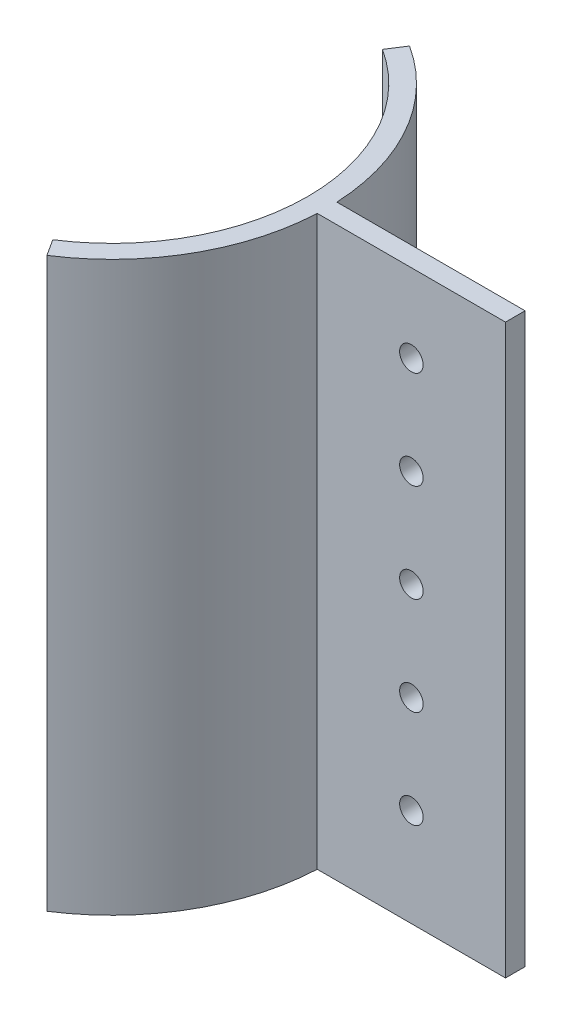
ISO-10303-21;
HEADER;
FILE_DESCRIPTION(('STEP AP214'),'2;1');
FILE_NAME('part.step','',(''),(''),'','','');
FILE_SCHEMA(('AUTOMOTIVE_DESIGN { 1 0 10303 214 1 1 1 1 }'));
ENDSEC;
DATA;
#1=APPLICATION_CONTEXT('core data for automotive mechanical design processes');
#2=APPLICATION_PROTOCOL_DEFINITION('international standard','automotive_design',2000,#1);
#3=PRODUCT_CONTEXT('',#1,'mechanical');
#4=PRODUCT('Part','Part','',(#3));
#5=PRODUCT_RELATED_PRODUCT_CATEGORY('part','',(#4));
#6=PRODUCT_DEFINITION_FORMATION('','',#4);
#7=PRODUCT_DEFINITION_CONTEXT('part definition',#1,'design');
#8=PRODUCT_DEFINITION('design','',#6,#7);
#9=PRODUCT_DEFINITION_SHAPE('','',#8);
#10=(LENGTH_UNIT() NAMED_UNIT(*) SI_UNIT(.MILLI.,.METRE.));
#11=(NAMED_UNIT(*) PLANE_ANGLE_UNIT() SI_UNIT($,.RADIAN.));
#12=(NAMED_UNIT(*) SI_UNIT($,.STERADIAN.) SOLID_ANGLE_UNIT());
#13=UNCERTAINTY_MEASURE_WITH_UNIT(LENGTH_MEASURE(1.E-05),#10,'distance_accuracy_value','');
#14=(GEOMETRIC_REPRESENTATION_CONTEXT(3) GLOBAL_UNCERTAINTY_ASSIGNED_CONTEXT((#13)) GLOBAL_UNIT_ASSIGNED_CONTEXT((#10,
#11,#12)) REPRESENTATION_CONTEXT('',''));
#15=CARTESIAN_POINT('',(0.,0.,0.));
#16=DIRECTION('',(0.,0.,1.));
#17=DIRECTION('',(1.,0.,0.));
#18=AXIS2_PLACEMENT_3D('',#15,#16,#17);
#19=CARTESIAN_POINT('',(39.4857881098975,-23.75,1.25));
#20=DIRECTION('',(0.,0.,1.));
#21=DIRECTION('',(1.,0.,0.));
#22=AXIS2_PLACEMENT_3D('',#19,#20,#21);
#23=CYLINDRICAL_SURFACE('',#22,1.5);
#24=CARTESIAN_POINT('',(39.4857881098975,-23.75,-1.225));
#25=DIRECTION('',(0.,0.,1.));
#26=DIRECTION('',(1.,0.,0.));
#27=AXIS2_PLACEMENT_3D('',#24,#25,#26);
#28=CIRCLE('',#27,1.5);
#29=CARTESIAN_POINT('',(40.9857881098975,-23.75,-1.225));
#30=VERTEX_POINT('',#29);
#31=EDGE_CURVE('E11',#30,#30,#28,.T.);
#32=ORIENTED_EDGE('',*,*,#31,.F.);
#33=EDGE_LOOP('',(#32));
#34=FACE_BOUND('',#33,.T.);
#35=CARTESIAN_POINT('',(39.4857881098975,-23.75,1.25));
#36=DIRECTION('',(0.,0.,1.));
#37=DIRECTION('',(1.,0.,0.));
#38=AXIS2_PLACEMENT_3D('',#35,#36,#37);
#39=CIRCLE('',#38,1.5);
#40=CARTESIAN_POINT('',(40.9857881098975,-23.75,1.25));
#41=VERTEX_POINT('',#40);
#42=EDGE_CURVE('E186',#41,#41,#39,.T.);
#43=ORIENTED_EDGE('',*,*,#42,.T.);
#44=EDGE_LOOP('',(#43));
#45=FACE_BOUND('',#44,.T.);
#46=ADVANCED_FACE('F36',(#34,#45),#23,.F.);
#47=CARTESIAN_POINT('',(39.4857881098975,-23.75,-1.225));
#48=DIRECTION('',(0.,0.,-1.));
#49=DIRECTION('',(-1.,0.,0.));
#50=AXIS2_PLACEMENT_3D('',#47,#48,#49);
#51=CONICAL_SURFACE('',#50,1.5,0.78539816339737);
#52=CARTESIAN_POINT('',(39.4857881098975,-23.75,-1.25));
#53=DIRECTION('',(0.,0.,1.));
#54=DIRECTION('',(1.,0.,0.));
#55=AXIS2_PLACEMENT_3D('',#52,#53,#54);
#56=CIRCLE('',#55,1.525);
#57=CARTESIAN_POINT('',(41.0107881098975,-23.75,-1.25));
#58=VERTEX_POINT('',#57);
#59=EDGE_CURVE('E43',#58,#58,#56,.T.);
#60=ORIENTED_EDGE('',*,*,#59,.F.);
#61=EDGE_LOOP('',(#60));
#62=FACE_BOUND('',#61,.T.);
#63=ORIENTED_EDGE('',*,*,#31,.T.);
#64=EDGE_LOOP('',(#63));
#65=FACE_BOUND('',#64,.T.);
#66=ADVANCED_FACE('F193',(#62,#65),#51,.F.);
#67=CARTESIAN_POINT('',(39.4857881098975,-11.25,1.25));
#68=DIRECTION('',(0.,0.,1.));
#69=DIRECTION('',(1.,0.,0.));
#70=AXIS2_PLACEMENT_3D('',#67,#68,#69);
#71=CYLINDRICAL_SURFACE('',#70,1.5);
#72=CARTESIAN_POINT('',(39.4857881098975,-11.25,-1.225));
#73=DIRECTION('',(0.,0.,1.));
#74=DIRECTION('',(1.,0.,0.));
#75=AXIS2_PLACEMENT_3D('',#72,#73,#74);
#76=CIRCLE('',#75,1.5);
#77=CARTESIAN_POINT('',(40.9857881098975,-11.25,-1.225));
#78=VERTEX_POINT('',#77);
#79=EDGE_CURVE('E183',#78,#78,#76,.T.);
#80=ORIENTED_EDGE('',*,*,#79,.F.);
#81=EDGE_LOOP('',(#80));
#82=FACE_BOUND('',#81,.T.);
#83=CARTESIAN_POINT('',(39.4857881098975,-11.25,1.25));
#84=DIRECTION('',(0.,0.,1.));
#85=DIRECTION('',(1.,0.,0.));
#86=AXIS2_PLACEMENT_3D('',#83,#84,#85);
#87=CIRCLE('',#86,1.5);
#88=CARTESIAN_POINT('',(40.9857881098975,-11.25,1.25));
#89=VERTEX_POINT('',#88);
#90=EDGE_CURVE('E177',#89,#89,#87,.T.);
#91=ORIENTED_EDGE('',*,*,#90,.T.);
#92=EDGE_LOOP('',(#91));
#93=FACE_BOUND('',#92,.T.);
#94=ADVANCED_FACE('F196',(#82,#93),#71,.F.);
#95=CARTESIAN_POINT('',(39.4857881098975,-11.25,-1.225));
#96=DIRECTION('',(0.,0.,-1.));
#97=DIRECTION('',(-1.,0.,0.));
#98=AXIS2_PLACEMENT_3D('',#95,#96,#97);
#99=CONICAL_SURFACE('',#98,1.5,0.78539816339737);
#100=CARTESIAN_POINT('',(39.4857881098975,-11.25,-1.25));
#101=DIRECTION('',(0.,0.,1.));
#102=DIRECTION('',(1.,0.,0.));
#103=AXIS2_PLACEMENT_3D('',#100,#101,#102);
#104=CIRCLE('',#103,1.525);
#105=CARTESIAN_POINT('',(41.0107881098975,-11.25,-1.25));
#106=VERTEX_POINT('',#105);
#107=EDGE_CURVE('E180',#106,#106,#104,.T.);
#108=ORIENTED_EDGE('',*,*,#107,.F.);
#109=EDGE_LOOP('',(#108));
#110=FACE_BOUND('',#109,.T.);
#111=ORIENTED_EDGE('',*,*,#79,.T.);
#112=EDGE_LOOP('',(#111));
#113=FACE_BOUND('',#112,.T.);
#114=ADVANCED_FACE('F249',(#110,#113),#99,.F.);
#115=CARTESIAN_POINT('',(39.4857881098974,1.24999999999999,1.25));
#116=DIRECTION('',(0.,0.,1.));
#117=DIRECTION('',(1.,0.,0.));
#118=AXIS2_PLACEMENT_3D('',#115,#116,#117);
#119=CYLINDRICAL_SURFACE('',#118,1.5);
#120=CARTESIAN_POINT('',(39.4857881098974,1.24999999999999,-1.225));
#121=DIRECTION('',(0.,0.,1.));
#122=DIRECTION('',(1.,0.,0.));
#123=AXIS2_PLACEMENT_3D('',#120,#121,#122);
#124=CIRCLE('',#123,1.5);
#125=CARTESIAN_POINT('',(40.9857881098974,1.24999999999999,-1.225));
#126=VERTEX_POINT('',#125);
#127=EDGE_CURVE('E174',#126,#126,#124,.T.);
#128=ORIENTED_EDGE('',*,*,#127,.F.);
#129=EDGE_LOOP('',(#128));
#130=FACE_BOUND('',#129,.T.);
#131=CARTESIAN_POINT('',(39.4857881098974,1.24999999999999,1.25));
#132=DIRECTION('',(0.,0.,1.));
#133=DIRECTION('',(1.,0.,0.));
#134=AXIS2_PLACEMENT_3D('',#131,#132,#133);
#135=CIRCLE('',#134,1.5);
#136=CARTESIAN_POINT('',(40.9857881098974,1.24999999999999,1.25));
#137=VERTEX_POINT('',#136);
#138=EDGE_CURVE('E168',#137,#137,#135,.T.);
#139=ORIENTED_EDGE('',*,*,#138,.T.);
#140=EDGE_LOOP('',(#139));
#141=FACE_BOUND('',#140,.T.);
#142=ADVANCED_FACE('F245',(#130,#141),#119,.F.);
#143=CARTESIAN_POINT('',(39.4857881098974,1.24999999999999,-1.225));
#144=DIRECTION('',(0.,0.,-1.));
#145=DIRECTION('',(-1.,0.,0.));
#146=AXIS2_PLACEMENT_3D('',#143,#144,#145);
#147=CONICAL_SURFACE('',#146,1.5,0.78539816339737);
#148=CARTESIAN_POINT('',(39.4857881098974,1.24999999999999,-1.25));
#149=DIRECTION('',(0.,0.,1.));
#150=DIRECTION('',(1.,0.,0.));
#151=AXIS2_PLACEMENT_3D('',#148,#149,#150);
#152=CIRCLE('',#151,1.525);
#153=CARTESIAN_POINT('',(41.0107881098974,1.24999999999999,-1.25));
#154=VERTEX_POINT('',#153);
#155=EDGE_CURVE('E171',#154,#154,#152,.T.);
#156=ORIENTED_EDGE('',*,*,#155,.F.);
#157=EDGE_LOOP('',(#156));
#158=FACE_BOUND('',#157,.T.);
#159=ORIENTED_EDGE('',*,*,#127,.T.);
#160=EDGE_LOOP('',(#159));
#161=FACE_BOUND('',#160,.T.);
#162=ADVANCED_FACE('F242',(#158,#161),#147,.F.);
#163=CARTESIAN_POINT('',(0.,36.25,0.));
#164=DIRECTION('',(0.,-1.,0.));
#165=DIRECTION('',(0.,0.,-1.));
#166=AXIS2_PLACEMENT_3D('',#163,#164,#165);
#167=CYLINDRICAL_SURFACE('',#166,27.5);
#168=CARTESIAN_POINT('',(0.,-36.25,0.));
#169=DIRECTION('',(0.,1.,0.));
#170=DIRECTION('',(1.,0.,0.));
#171=AXIS2_PLACEMENT_3D('',#168,#169,#170);
#172=CIRCLE('',#171,27.5);
#173=CARTESIAN_POINT('',(27.4715762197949,-36.25,1.25));
#174=VERTEX_POINT('',#173);
#175=CARTESIAN_POINT('',(14.8583134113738,-36.25,23.1404520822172));
#176=VERTEX_POINT('',#175);
#177=EDGE_CURVE('E55',#174,#176,#172,.F.);
#178=ORIENTED_EDGE('',*,*,#177,.F.);
#179=DIRECTION('',(0.,-1.,0.));
#180=VECTOR('',#179,1.);
#181=CARTESIAN_POINT('',(27.4715762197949,36.25,1.25));
#182=LINE('',#181,#180);
#183=CARTESIAN_POINT('',(27.4715762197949,36.25,1.25));
#184=VERTEX_POINT('',#183);
#185=EDGE_CURVE('E50',#174,#184,#182,.F.);
#186=ORIENTED_EDGE('',*,*,#185,.T.);
#187=CARTESIAN_POINT('',(0.,36.25,0.));
#188=DIRECTION('',(0.,1.,0.));
#189=DIRECTION('',(1.,0.,0.));
#190=AXIS2_PLACEMENT_3D('',#187,#188,#189);
#191=CIRCLE('',#190,27.5);
#192=CARTESIAN_POINT('',(14.8583134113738,36.25,23.1404520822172));
#193=VERTEX_POINT('',#192);
#194=EDGE_CURVE('E105',#184,#193,#191,.F.);
#195=ORIENTED_EDGE('',*,*,#194,.T.);
#196=DIRECTION('',(0.,-1.,0.));
#197=VECTOR('',#196,1.);
#198=CARTESIAN_POINT('',(14.8583134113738,36.25,23.1404520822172));
#199=LINE('',#198,#197);
#200=EDGE_CURVE('E164',#193,#176,#199,.T.);
#201=ORIENTED_EDGE('',*,*,#200,.T.);
#202=EDGE_LOOP('',(#178,#186,#195,#201));
#203=FACE_BOUND('',#202,.T.);
#204=ADVANCED_FACE('F234',(#203),#167,.T.);
#205=CARTESIAN_POINT('',(0.,36.25,0.));
#206=DIRECTION('',(0.,-1.,0.));
#207=DIRECTION('',(0.,0.,-1.));
#208=AXIS2_PLACEMENT_3D('',#205,#206,#207);
#209=CYLINDRICAL_SURFACE('',#208,25.);
#210=CARTESIAN_POINT('',(0.,-36.25,0.));
#211=DIRECTION('',(0.,-1.,0.));
#212=DIRECTION('',(0.,0.,-1.));
#213=AXIS2_PLACEMENT_3D('',#210,#211,#212);
#214=CIRCLE('',#213,25.);
#215=CARTESIAN_POINT('',(13.5075576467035,-36.25,-21.0367746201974));
#216=VERTEX_POINT('',#215);
#217=CARTESIAN_POINT('',(13.5075576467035,-36.25,21.0367746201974));
#218=VERTEX_POINT('',#217);
#219=EDGE_CURVE('E138',#216,#218,#214,.T.);
#220=ORIENTED_EDGE('',*,*,#219,.T.);
#221=DIRECTION('',(0.,-1.,0.));
#222=VECTOR('',#221,1.);
#223=CARTESIAN_POINT('',(13.5075576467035,36.25,21.0367746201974));
#224=LINE('',#223,#222);
#225=CARTESIAN_POINT('',(13.5075576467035,36.25,21.0367746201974));
#226=VERTEX_POINT('',#225);
#227=EDGE_CURVE('E166',#226,#218,#224,.T.);
#228=ORIENTED_EDGE('',*,*,#227,.F.);
#229=CARTESIAN_POINT('',(0.,36.25,0.));
#230=DIRECTION('',(0.,-1.,0.));
#231=DIRECTION('',(0.,0.,-1.));
#232=AXIS2_PLACEMENT_3D('',#229,#230,#231);
#233=CIRCLE('',#232,25.);
#234=CARTESIAN_POINT('',(13.5075576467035,36.25,-21.0367746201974));
#235=VERTEX_POINT('',#234);
#236=EDGE_CURVE('E139',#235,#226,#233,.T.);
#237=ORIENTED_EDGE('',*,*,#236,.F.);
#238=DIRECTION('',(0.,-1.,0.));
#239=VECTOR('',#238,1.);
#240=CARTESIAN_POINT('',(13.5075576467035,36.25,-21.0367746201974));
#241=LINE('',#240,#239);
#242=EDGE_CURVE('E150',#235,#216,#241,.T.);
#243=ORIENTED_EDGE('',*,*,#242,.T.);
#244=EDGE_LOOP('',(#220,#228,#237,#243));
#245=FACE_BOUND('',#244,.T.);
#246=ADVANCED_FACE('F237',(#245),#209,.F.);
#247=CARTESIAN_POINT('',(14.8583134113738,36.25,23.1404520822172));
#248=DIRECTION('',(-0.841470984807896,0.,0.540302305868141));
#249=DIRECTION('',(0.540302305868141,0.,0.841470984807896));
#250=AXIS2_PLACEMENT_3D('',#247,#248,#249);
#251=PLANE('',#250);
#252=DIRECTION('',(-0.540302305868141,0.,-0.841470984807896));
#253=VECTOR('',#252,1.);
#254=CARTESIAN_POINT('',(14.8583134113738,-36.25,23.1404520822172));
#255=LINE('',#254,#253);
#256=EDGE_CURVE('E153',#176,#218,#255,.T.);
#257=ORIENTED_EDGE('',*,*,#256,.F.);
#258=ORIENTED_EDGE('',*,*,#200,.F.);
#259=DIRECTION('',(-0.540302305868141,0.,-0.841470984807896));
#260=VECTOR('',#259,1.);
#261=CARTESIAN_POINT('',(14.8583134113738,36.25,23.1404520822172));
#262=LINE('',#261,#260);
#263=EDGE_CURVE('E141',#193,#226,#262,.T.);
#264=ORIENTED_EDGE('',*,*,#263,.T.);
#265=ORIENTED_EDGE('',*,*,#227,.T.);
#266=EDGE_LOOP('',(#257,#258,#264,#265));
#267=FACE_BOUND('',#266,.T.);
#268=ADVANCED_FACE('F232',(#267),#251,.T.);
#269=DIRECTION('',(0.,-1.,0.));
#270=VECTOR('',#269,1.);
#271=CARTESIAN_POINT('',(27.4715762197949,36.25,-1.25));
#272=LINE('',#271,#270);
#273=CARTESIAN_POINT('',(27.4715762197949,-36.25,-1.25));
#274=VERTEX_POINT('',#273);
#275=CARTESIAN_POINT('',(27.4715762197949,36.25,-1.25));
#276=VERTEX_POINT('',#275);
#277=EDGE_CURVE('E133',#274,#276,#272,.F.);
#278=ORIENTED_EDGE('',*,*,#277,.F.);
#279=CARTESIAN_POINT('',(14.8583134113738,-36.25,-23.1404520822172));
#280=VERTEX_POINT('',#279);
#281=EDGE_CURVE('E156',#280,#274,#172,.F.);
#282=ORIENTED_EDGE('',*,*,#281,.F.);
#283=DIRECTION('',(0.,-1.,0.));
#284=VECTOR('',#283,1.);
#285=CARTESIAN_POINT('',(14.8583134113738,36.25,-23.1404520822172));
#286=LINE('',#285,#284);
#287=CARTESIAN_POINT('',(14.8583134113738,36.25,-23.1404520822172));
#288=VERTEX_POINT('',#287);
#289=EDGE_CURVE('E162',#288,#280,#286,.T.);
#290=ORIENTED_EDGE('',*,*,#289,.F.);
#291=EDGE_CURVE('E145',#288,#276,#191,.F.);
#292=ORIENTED_EDGE('',*,*,#291,.T.);
#293=EDGE_LOOP('',(#278,#282,#290,#292));
#294=FACE_BOUND('',#293,.T.);
#295=ADVANCED_FACE('F228',(#294),#167,.T.);
#296=CARTESIAN_POINT('',(13.5075576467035,36.25,-21.0367746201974));
#297=DIRECTION('',(-0.841470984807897,0.,-0.54030230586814));
#298=DIRECTION('',(-0.54030230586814,0.,0.841470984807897));
#299=AXIS2_PLACEMENT_3D('',#296,#297,#298);
#300=PLANE('',#299);
#301=DIRECTION('',(0.54030230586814,0.,-0.841470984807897));
#302=VECTOR('',#301,1.);
#303=CARTESIAN_POINT('',(13.5075576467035,-36.25,-21.0367746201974));
#304=LINE('',#303,#302);
#305=EDGE_CURVE('E142',#216,#280,#304,.T.);
#306=ORIENTED_EDGE('',*,*,#305,.F.);
#307=ORIENTED_EDGE('',*,*,#242,.F.);
#308=DIRECTION('',(0.54030230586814,0.,-0.841470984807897));
#309=VECTOR('',#308,1.);
#310=CARTESIAN_POINT('',(13.5075576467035,36.25,-21.0367746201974));
#311=LINE('',#310,#309);
#312=EDGE_CURVE('E147',#235,#288,#311,.T.);
#313=ORIENTED_EDGE('',*,*,#312,.T.);
#314=ORIENTED_EDGE('',*,*,#289,.T.);
#315=EDGE_LOOP('',(#306,#307,#313,#314));
#316=FACE_BOUND('',#315,.T.);
#317=ADVANCED_FACE('F222',(#316),#300,.T.);
#318=CARTESIAN_POINT('',(0.,36.25,0.));
#319=DIRECTION('',(0.,-1.,0.));
#320=DIRECTION('',(-1.,0.,0.));
#321=AXIS2_PLACEMENT_3D('',#318,#319,#320);
#322=PLANE('',#321);
#323=ORIENTED_EDGE('',*,*,#194,.F.);
#324=DIRECTION('',(1.,0.,0.));
#325=VECTOR('',#324,1.);
#326=CARTESIAN_POINT('',(26.5,36.25,1.25));
#327=LINE('',#326,#325);
#328=CARTESIAN_POINT('',(51.5,36.25,1.25));
#329=VERTEX_POINT('',#328);
#330=EDGE_CURVE('E98',#184,#329,#327,.T.);
#331=ORIENTED_EDGE('',*,*,#330,.T.);
#332=DIRECTION('',(0.,0.,-1.));
#333=VECTOR('',#332,1.);
#334=CARTESIAN_POINT('',(51.5,36.25,1.25));
#335=LINE('',#334,#333);
#336=CARTESIAN_POINT('',(51.5,36.25,-1.25));
#337=VERTEX_POINT('',#336);
#338=EDGE_CURVE('E102',#329,#337,#335,.T.);
#339=ORIENTED_EDGE('',*,*,#338,.T.);
#340=DIRECTION('',(1.,0.,0.));
#341=VECTOR('',#340,1.);
#342=CARTESIAN_POINT('',(26.5,36.25,-1.25));
#343=LINE('',#342,#341);
#344=EDGE_CURVE('E128',#276,#337,#343,.T.);
#345=ORIENTED_EDGE('',*,*,#344,.F.);
#346=ORIENTED_EDGE('',*,*,#291,.F.);
#347=ORIENTED_EDGE('',*,*,#312,.F.);
#348=ORIENTED_EDGE('',*,*,#236,.T.);
#349=ORIENTED_EDGE('',*,*,#263,.F.);
#350=EDGE_LOOP('',(#323,#331,#339,#345,#346,#347,#348,#349));
#351=FACE_BOUND('',#350,.T.);
#352=ADVANCED_FACE('F100',(#351),#322,.F.);
#353=CARTESIAN_POINT('',(0.,-36.25,0.));
#354=DIRECTION('',(0.,-1.,0.));
#355=DIRECTION('',(-1.,0.,0.));
#356=AXIS2_PLACEMENT_3D('',#353,#354,#355);
#357=PLANE('',#356);
#358=ORIENTED_EDGE('',*,*,#281,.T.);
#359=DIRECTION('',(1.,0.,0.));
#360=VECTOR('',#359,1.);
#361=CARTESIAN_POINT('',(26.5,-36.25,-1.25));
#362=LINE('',#361,#360);
#363=CARTESIAN_POINT('',(51.5,-36.25,-1.25));
#364=VERTEX_POINT('',#363);
#365=EDGE_CURVE('E109',#274,#364,#362,.T.);
#366=ORIENTED_EDGE('',*,*,#365,.T.);
#367=DIRECTION('',(0.,0.,-1.));
#368=VECTOR('',#367,1.);
#369=CARTESIAN_POINT('',(51.5,-36.25,1.25));
#370=LINE('',#369,#368);
#371=CARTESIAN_POINT('',(51.5,-36.25,1.25));
#372=VERTEX_POINT('',#371);
#373=EDGE_CURVE('E117',#372,#364,#370,.T.);
#374=ORIENTED_EDGE('',*,*,#373,.F.);
#375=DIRECTION('',(1.,0.,0.));
#376=VECTOR('',#375,1.);
#377=CARTESIAN_POINT('',(26.5,-36.25,1.25));
#378=LINE('',#377,#376);
#379=EDGE_CURVE('E118',#174,#372,#378,.T.);
#380=ORIENTED_EDGE('',*,*,#379,.F.);
#381=ORIENTED_EDGE('',*,*,#177,.T.);
#382=ORIENTED_EDGE('',*,*,#256,.T.);
#383=ORIENTED_EDGE('',*,*,#219,.F.);
#384=ORIENTED_EDGE('',*,*,#305,.T.);
#385=EDGE_LOOP('',(#358,#366,#374,#380,#381,#382,#383,#384));
#386=FACE_BOUND('',#385,.T.);
#387=ADVANCED_FACE('F213',(#386),#357,.T.);
#388=CARTESIAN_POINT('',(51.5,36.25,1.25));
#389=DIRECTION('',(1.,0.,0.));
#390=DIRECTION('',(0.,1.,0.));
#391=AXIS2_PLACEMENT_3D('',#388,#389,#390);
#392=PLANE('',#391);
#393=DIRECTION('',(0.,-1.,0.));
#394=VECTOR('',#393,1.);
#395=CARTESIAN_POINT('',(51.5,36.25,-1.25));
#396=LINE('',#395,#394);
#397=EDGE_CURVE('E116',#337,#364,#396,.T.);
#398=ORIENTED_EDGE('',*,*,#397,.F.);
#399=ORIENTED_EDGE('',*,*,#338,.F.);
#400=DIRECTION('',(0.,-1.,0.));
#401=VECTOR('',#400,1.);
#402=CARTESIAN_POINT('',(51.5,36.25,1.25));
#403=LINE('',#402,#401);
#404=EDGE_CURVE('E108',#329,#372,#403,.T.);
#405=ORIENTED_EDGE('',*,*,#404,.T.);
#406=ORIENTED_EDGE('',*,*,#373,.T.);
#407=EDGE_LOOP('',(#398,#399,#405,#406));
#408=FACE_BOUND('',#407,.T.);
#409=ADVANCED_FACE('F113',(#408),#392,.T.);
#410=CARTESIAN_POINT('',(0.,0.,1.25));
#411=DIRECTION('',(0.,0.,-1.));
#412=DIRECTION('',(-1.,0.,0.));
#413=AXIS2_PLACEMENT_3D('',#410,#411,#412);
#414=PLANE('',#413);
#415=CARTESIAN_POINT('',(39.4857881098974,13.75,1.25));
#416=DIRECTION('',(0.,0.,1.));
#417=DIRECTION('',(1.,0.,0.));
#418=AXIS2_PLACEMENT_3D('',#415,#416,#417);
#419=CIRCLE('',#418,1.5);
#420=CARTESIAN_POINT('',(40.9857881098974,13.75,1.25));
#421=VERTEX_POINT('',#420);
#422=EDGE_CURVE('E377',#421,#421,#419,.T.);
#423=ORIENTED_EDGE('',*,*,#422,.F.);
#424=EDGE_LOOP('',(#423));
#425=FACE_BOUND('',#424,.T.);
#426=CARTESIAN_POINT('',(39.4857881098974,26.25,1.25));
#427=DIRECTION('',(0.,0.,1.));
#428=DIRECTION('',(1.,0.,0.));
#429=AXIS2_PLACEMENT_3D('',#426,#427,#428);
#430=CIRCLE('',#429,1.5);
#431=CARTESIAN_POINT('',(40.9857881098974,26.25,1.25));
#432=VERTEX_POINT('',#431);
#433=EDGE_CURVE('E387',#432,#432,#430,.T.);
#434=ORIENTED_EDGE('',*,*,#433,.F.);
#435=EDGE_LOOP('',(#434));
#436=FACE_BOUND('',#435,.T.);
#437=ORIENTED_EDGE('',*,*,#185,.F.);
#438=ORIENTED_EDGE('',*,*,#379,.T.);
#439=ORIENTED_EDGE('',*,*,#404,.F.);
#440=ORIENTED_EDGE('',*,*,#330,.F.);
#441=EDGE_LOOP('',(#437,#438,#439,#440));
#442=FACE_BOUND('',#441,.T.);
#443=ORIENTED_EDGE('',*,*,#138,.F.);
#444=EDGE_LOOP('',(#443));
#445=FACE_BOUND('',#444,.T.);
#446=ORIENTED_EDGE('',*,*,#90,.F.);
#447=EDGE_LOOP('',(#446));
#448=FACE_BOUND('',#447,.T.);
#449=ORIENTED_EDGE('',*,*,#42,.F.);
#450=EDGE_LOOP('',(#449));
#451=FACE_BOUND('',#450,.T.);
#452=ADVANCED_FACE('F120',(#425,#436,#442,#445,#448,#451),#414,.F.);
#453=CARTESIAN_POINT('',(0.,0.,-1.25));
#454=DIRECTION('',(0.,0.,-1.));
#455=DIRECTION('',(-1.,0.,0.));
#456=AXIS2_PLACEMENT_3D('',#453,#454,#455);
#457=PLANE('',#456);
#458=CARTESIAN_POINT('',(39.4857881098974,13.75,-1.25));
#459=DIRECTION('',(0.,0.,1.));
#460=DIRECTION('',(1.,0.,0.));
#461=AXIS2_PLACEMENT_3D('',#458,#459,#460);
#462=CIRCLE('',#461,1.525);
#463=CARTESIAN_POINT('',(41.0107881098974,13.75,-1.25));
#464=VERTEX_POINT('',#463);
#465=EDGE_CURVE('E378',#464,#464,#462,.T.);
#466=ORIENTED_EDGE('',*,*,#465,.T.);
#467=EDGE_LOOP('',(#466));
#468=FACE_BOUND('',#467,.T.);
#469=CARTESIAN_POINT('',(39.4857881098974,26.25,-1.25));
#470=DIRECTION('',(0.,0.,1.));
#471=DIRECTION('',(1.,0.,0.));
#472=AXIS2_PLACEMENT_3D('',#469,#470,#471);
#473=CIRCLE('',#472,1.525);
#474=CARTESIAN_POINT('',(41.0107881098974,26.25,-1.25));
#475=VERTEX_POINT('',#474);
#476=EDGE_CURVE('E384',#475,#475,#473,.T.);
#477=ORIENTED_EDGE('',*,*,#476,.T.);
#478=EDGE_LOOP('',(#477));
#479=FACE_BOUND('',#478,.T.);
#480=ORIENTED_EDGE('',*,*,#365,.F.);
#481=ORIENTED_EDGE('',*,*,#277,.T.);
#482=ORIENTED_EDGE('',*,*,#344,.T.);
#483=ORIENTED_EDGE('',*,*,#397,.T.);
#484=EDGE_LOOP('',(#480,#481,#482,#483));
#485=FACE_BOUND('',#484,.T.);
#486=ORIENTED_EDGE('',*,*,#155,.T.);
#487=EDGE_LOOP('',(#486));
#488=FACE_BOUND('',#487,.T.);
#489=ORIENTED_EDGE('',*,*,#107,.T.);
#490=EDGE_LOOP('',(#489));
#491=FACE_BOUND('',#490,.T.);
#492=ORIENTED_EDGE('',*,*,#59,.T.);
#493=EDGE_LOOP('',(#492));
#494=FACE_BOUND('',#493,.T.);
#495=ADVANCED_FACE('F191',(#468,#479,#485,#488,#491,#494),#457,.T.);
#496=CARTESIAN_POINT('',(39.4857881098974,26.25,-1.225));
#497=DIRECTION('',(0.,0.,-1.));
#498=DIRECTION('',(-1.,0.,0.));
#499=AXIS2_PLACEMENT_3D('',#496,#497,#498);
#500=CONICAL_SURFACE('',#499,1.5,0.78539816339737);
#501=ORIENTED_EDGE('',*,*,#476,.F.);
#502=EDGE_LOOP('',(#501));
#503=FACE_BOUND('',#502,.T.);
#504=CARTESIAN_POINT('',(39.4857881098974,26.25,-1.225));
#505=DIRECTION('',(0.,0.,1.));
#506=DIRECTION('',(1.,0.,0.));
#507=AXIS2_PLACEMENT_3D('',#504,#505,#506);
#508=CIRCLE('',#507,1.5);
#509=CARTESIAN_POINT('',(40.9857881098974,26.25,-1.225));
#510=VERTEX_POINT('',#509);
#511=EDGE_CURVE('E130',#510,#510,#508,.T.);
#512=ORIENTED_EDGE('',*,*,#511,.T.);
#513=EDGE_LOOP('',(#512));
#514=FACE_BOUND('',#513,.T.);
#515=ADVANCED_FACE('F210',(#503,#514),#500,.F.);
#516=CARTESIAN_POINT('',(39.4857881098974,26.25,1.25));
#517=DIRECTION('',(0.,0.,1.));
#518=DIRECTION('',(1.,0.,0.));
#519=AXIS2_PLACEMENT_3D('',#516,#517,#518);
#520=CYLINDRICAL_SURFACE('',#519,1.5);
#521=ORIENTED_EDGE('',*,*,#511,.F.);
#522=EDGE_LOOP('',(#521));
#523=FACE_BOUND('',#522,.T.);
#524=ORIENTED_EDGE('',*,*,#433,.T.);
#525=EDGE_LOOP('',(#524));
#526=FACE_BOUND('',#525,.T.);
#527=ADVANCED_FACE('F320',(#523,#526),#520,.F.);
#528=CARTESIAN_POINT('',(39.4857881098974,13.75,-1.225));
#529=DIRECTION('',(0.,0.,-1.));
#530=DIRECTION('',(-1.,0.,0.));
#531=AXIS2_PLACEMENT_3D('',#528,#529,#530);
#532=CONICAL_SURFACE('',#531,1.5,0.78539816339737);
#533=ORIENTED_EDGE('',*,*,#465,.F.);
#534=EDGE_LOOP('',(#533));
#535=FACE_BOUND('',#534,.T.);
#536=CARTESIAN_POINT('',(39.4857881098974,13.75,-1.225));
#537=DIRECTION('',(0.,0.,1.));
#538=DIRECTION('',(1.,0.,0.));
#539=AXIS2_PLACEMENT_3D('',#536,#537,#538);
#540=CIRCLE('',#539,1.5);
#541=CARTESIAN_POINT('',(40.9857881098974,13.75,-1.225));
#542=VERTEX_POINT('',#541);
#543=EDGE_CURVE('E375',#542,#542,#540,.T.);
#544=ORIENTED_EDGE('',*,*,#543,.T.);
#545=EDGE_LOOP('',(#544));
#546=FACE_BOUND('',#545,.T.);
#547=ADVANCED_FACE('F330',(#535,#546),#532,.F.);
#548=CARTESIAN_POINT('',(39.4857881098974,13.75,1.25));
#549=DIRECTION('',(0.,0.,1.));
#550=DIRECTION('',(1.,0.,0.));
#551=AXIS2_PLACEMENT_3D('',#548,#549,#550);
#552=CYLINDRICAL_SURFACE('',#551,1.5);
#553=ORIENTED_EDGE('',*,*,#543,.F.);
#554=EDGE_LOOP('',(#553));
#555=FACE_BOUND('',#554,.T.);
#556=ORIENTED_EDGE('',*,*,#422,.T.);
#557=EDGE_LOOP('',(#556));
#558=FACE_BOUND('',#557,.T.);
#559=ADVANCED_FACE('F358',(#555,#558),#552,.F.);
#560=CLOSED_SHELL('',(#46,#66,#94,#114,#142,#162,#204,#246,#268,#295,#317,#352,#387,#409,#452,
#495,#515,#527,#547,#559));
#561=MANIFOLD_SOLID_BREP('B2',#560);
#562=ADVANCED_BREP_SHAPE_REPRESENTATION('',(#18,#561),#14);
#563=SHAPE_DEFINITION_REPRESENTATION(#9,#562);
ENDSEC;
END-ISO-10303-21;
